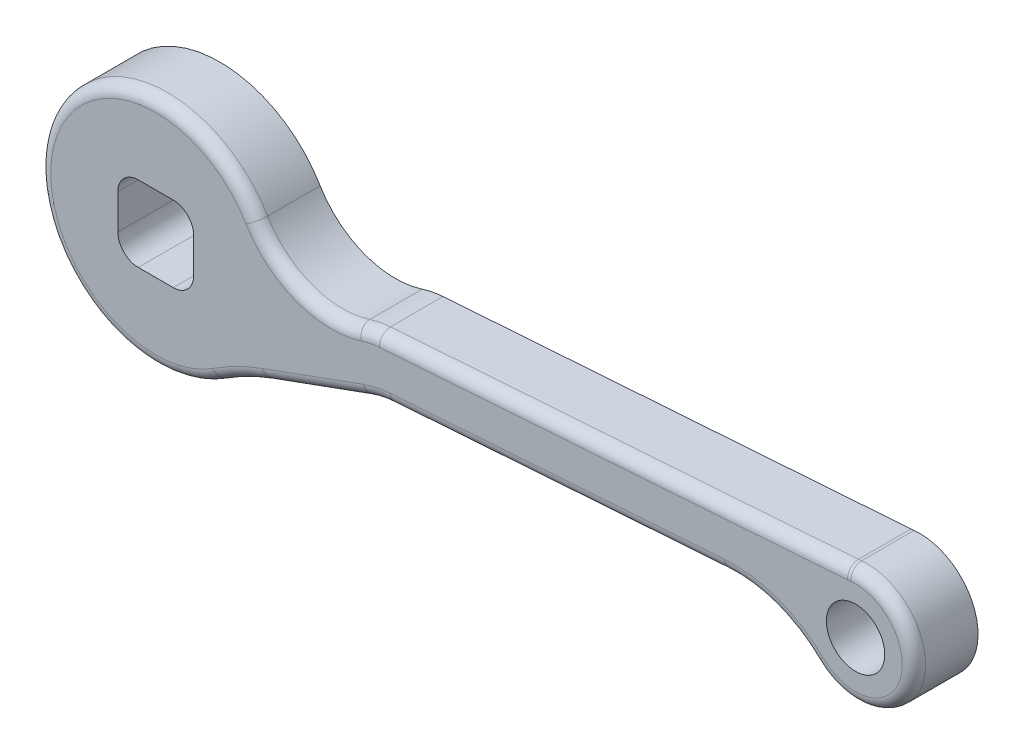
ISO-10303-21;
HEADER;
FILE_DESCRIPTION(('STEP AP214'),'2;1');
FILE_NAME('part.step','',(''),(''),'','','');
FILE_SCHEMA(('AUTOMOTIVE_DESIGN { 1 0 10303 214 1 1 1 1 }'));
ENDSEC;
DATA;
#1=APPLICATION_CONTEXT('core data for automotive mechanical design processes');
#2=APPLICATION_PROTOCOL_DEFINITION('international standard','automotive_design',2000,#1);
#3=PRODUCT_CONTEXT('',#1,'mechanical');
#4=PRODUCT('Part','Part','',(#3));
#5=PRODUCT_RELATED_PRODUCT_CATEGORY('part','',(#4));
#6=PRODUCT_DEFINITION_FORMATION('','',#4);
#7=PRODUCT_DEFINITION_CONTEXT('part definition',#1,'design');
#8=PRODUCT_DEFINITION('design','',#6,#7);
#9=PRODUCT_DEFINITION_SHAPE('','',#8);
#10=(LENGTH_UNIT() NAMED_UNIT(*) SI_UNIT(.MILLI.,.METRE.));
#11=(NAMED_UNIT(*) PLANE_ANGLE_UNIT() SI_UNIT($,.RADIAN.));
#12=(NAMED_UNIT(*) SI_UNIT($,.STERADIAN.) SOLID_ANGLE_UNIT());
#13=UNCERTAINTY_MEASURE_WITH_UNIT(LENGTH_MEASURE(1.E-05),#10,'distance_accuracy_value','');
#14=(GEOMETRIC_REPRESENTATION_CONTEXT(3) GLOBAL_UNCERTAINTY_ASSIGNED_CONTEXT((#13)) GLOBAL_UNIT_ASSIGNED_CONTEXT((#10,
#11,#12)) REPRESENTATION_CONTEXT('',''));
#15=CARTESIAN_POINT('',(0.,0.,0.));
#16=DIRECTION('',(0.,0.,1.));
#17=DIRECTION('',(1.,0.,0.));
#18=AXIS2_PLACEMENT_3D('',#15,#16,#17);
#19=CARTESIAN_POINT('',(30.0847533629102,17.8859613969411,11.));
#20=DIRECTION('',(0.,0.,-1.));
#21=DIRECTION('',(-1.,0.,0.));
#22=AXIS2_PLACEMENT_3D('',#19,#20,#21);
#23=PLANE('',#22);
#24=CARTESIAN_POINT('',(39.2901235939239,-10.666817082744,11.));
#25=DIRECTION('',(0.,0.,-1.));
#26=DIRECTION('',(-1.,0.,0.));
#27=AXIS2_PLACEMENT_3D('',#24,#25,#26);
#28=CIRCLE('',#27,13.);
#29=CARTESIAN_POINT('',(38.3832894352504,2.3015155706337,11.));
#30=VERTEX_POINT('',#29);
#31=CARTESIAN_POINT('',(35.3011298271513,1.70605359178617,11.));
#32=VERTEX_POINT('',#31);
#33=EDGE_CURVE('E351',#30,#32,#28,.F.);
#34=ORIENTED_EDGE('',*,*,#33,.T.);
#35=CARTESIAN_POINT('',(30.0847533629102,17.8859613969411,11.));
#36=DIRECTION('',(0.,0.,-1.));
#37=DIRECTION('',(-1.,0.,0.));
#38=AXIS2_PLACEMENT_3D('',#35,#36,#37);
#39=CIRCLE('',#38,17.);
#40=CARTESIAN_POINT('',(15.4721588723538,9.19849443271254,11.));
#41=VERTEX_POINT('',#40);
#42=EDGE_CURVE('E353',#32,#41,#39,.T.);
#43=ORIENTED_EDGE('',*,*,#42,.T.);
#44=CARTESIAN_POINT('',(0.,0.,11.));
#45=DIRECTION('',(0.,0.,-1.));
#46=DIRECTION('',(-1.,0.,0.));
#47=AXIS2_PLACEMENT_3D('',#44,#45,#46);
#48=CIRCLE('',#47,18.);
#49=CARTESIAN_POINT('',(9.80424171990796,-15.0955902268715,11.));
#50=VERTEX_POINT('',#49);
#51=EDGE_CURVE('E333',#41,#50,#48,.F.);
#52=ORIENTED_EDGE('',*,*,#51,.T.);
#53=CARTESIAN_POINT('',(32.6808057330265,-50.3186340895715,11.));
#54=DIRECTION('',(0.,0.,-1.));
#55=DIRECTION('',(-1.,0.,0.));
#56=AXIS2_PLACEMENT_3D('',#53,#54,#55);
#57=CIRCLE('',#56,42.);
#58=CARTESIAN_POINT('',(18.3159597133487,-10.8515440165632,11.));
#59=VERTEX_POINT('',#58);
#60=EDGE_CURVE('E335',#50,#59,#57,.T.);
#61=ORIENTED_EDGE('',*,*,#60,.T.);
#62=DIRECTION('',(0.939692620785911,0.342020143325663,0.));
#63=VECTOR('',#62,1.);
#64=CARTESIAN_POINT('',(37.9441222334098,-3.7074771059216,11.));
#65=LINE('',#64,#63);
#66=CARTESIAN_POINT('',(35.5753307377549,-4.56964670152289,11.));
#67=VERTEX_POINT('',#66);
#68=EDGE_CURVE('E337',#59,#67,#65,.T.);
#69=ORIENTED_EDGE('',*,*,#68,.T.);
#70=CARTESIAN_POINT('',(41.3896731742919,-20.5444212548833,11.));
#71=DIRECTION('',(0.,0.,-1.));
#72=DIRECTION('',(-1.,0.,0.));
#73=AXIS2_PLACEMENT_3D('',#70,#71,#72);
#74=CIRCLE('',#73,17.0000000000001);
#75=CARTESIAN_POINT('',(40.2038131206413,-3.58583240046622,11.));
#76=VERTEX_POINT('',#75);
#77=EDGE_CURVE('E339',#67,#76,#74,.T.);
#78=ORIENTED_EDGE('',*,*,#77,.T.);
#79=DIRECTION('',(0.997564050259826,0.0697564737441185,0.));
#80=VECTOR('',#79,1.);
#81=CARTESIAN_POINT('',(31.6281404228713,-4.18550185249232,11.));
#82=LINE('',#81,#80);
#83=CARTESIAN_POINT('',(97.5646681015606,0.425229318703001,11.));
#84=VERTEX_POINT('',#83);
#85=EDGE_CURVE('E341',#76,#84,#82,.T.);
#86=ORIENTED_EDGE('',*,*,#85,.T.);
#87=CARTESIAN_POINT('',(99.0993105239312,-21.5211797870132,11.));
#88=DIRECTION('',(0.,0.,-1.));
#89=DIRECTION('',(-1.,0.,0.));
#90=AXIS2_PLACEMENT_3D('',#87,#88,#89);
#91=CIRCLE('',#90,22.);
#92=CARTESIAN_POINT('',(114.426482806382,-5.73898127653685,11.));
#93=VERTEX_POINT('',#92);
#94=EDGE_CURVE('E343',#84,#93,#91,.T.);
#95=ORIENTED_EDGE('',*,*,#94,.T.);
#96=CARTESIAN_POINT('',(120.,0.,11.));
#97=DIRECTION('',(0.,0.,-1.));
#98=DIRECTION('',(-1.,0.,0.));
#99=AXIS2_PLACEMENT_3D('',#96,#97,#98);
#100=CIRCLE('',#99,8.);
#101=CARTESIAN_POINT('',(119.22805965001,7.96266965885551,11.));
#102=VERTEX_POINT('',#101);
#103=EDGE_CURVE('E345',#93,#102,#100,.F.);
#104=ORIENTED_EDGE('',*,*,#103,.T.);
#105=CARTESIAN_POINT('',(117.105223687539,29.8600112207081,11.));
#106=DIRECTION('',(0.,0.,-1.));
#107=DIRECTION('',(-1.,0.,0.));
#108=AXIS2_PLACEMENT_3D('',#105,#106,#107);
#109=CIRCLE('',#108,22.);
#110=CARTESIAN_POINT('',(118.639866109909,7.91360211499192,11.));
#111=VERTEX_POINT('',#110);
#112=EDGE_CURVE('E347',#102,#111,#109,.T.);
#113=ORIENTED_EDGE('',*,*,#112,.T.);
#114=DIRECTION('',(-0.997564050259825,-0.0697564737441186,0.));
#115=VECTOR('',#114,1.);
#116=CARTESIAN_POINT('',(31.2096015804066,1.79988244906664,11.));
#117=LINE('',#116,#115);
#118=EDGE_CURVE('E349',#111,#30,#117,.T.);
#119=ORIENTED_EDGE('',*,*,#118,.T.);
#120=EDGE_LOOP('',(#34,#43,#52,#61,#69,#78,#86,#95,#104,#113,#119));
#121=FACE_BOUND('',#120,.T.);
#122=CARTESIAN_POINT('',(120.,0.,11.));
#123=DIRECTION('',(0.,0.,1.));
#124=DIRECTION('',(1.,0.,0.));
#125=AXIS2_PLACEMENT_3D('',#122,#123,#124);
#126=CIRCLE('',#125,5.);
#127=CARTESIAN_POINT('',(125.,0.,11.));
#128=VERTEX_POINT('',#127);
#129=EDGE_CURVE('E275',#128,#128,#126,.T.);
#130=ORIENTED_EDGE('',*,*,#129,.F.);
#131=EDGE_LOOP('',(#130));
#132=FACE_BOUND('',#131,.T.);
#133=CARTESIAN_POINT('',(-3.,3.,11.));
#134=DIRECTION('',(0.,0.,1.));
#135=DIRECTION('',(1.,0.,0.));
#136=AXIS2_PLACEMENT_3D('',#133,#134,#135);
#137=CIRCLE('',#136,3.5);
#138=CARTESIAN_POINT('',(-2.99999999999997,6.5,11.));
#139=VERTEX_POINT('',#138);
#140=CARTESIAN_POINT('',(-6.5,2.99999999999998,11.));
#141=VERTEX_POINT('',#140);
#142=EDGE_CURVE('E216',#139,#141,#137,.T.);
#143=ORIENTED_EDGE('',*,*,#142,.F.);
#144=DIRECTION('',(-1.,0.,0.));
#145=VECTOR('',#144,1.);
#146=CARTESIAN_POINT('',(-2.99999999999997,6.5,11.));
#147=LINE('',#146,#145);
#148=CARTESIAN_POINT('',(2.99999999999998,6.5,11.));
#149=VERTEX_POINT('',#148);
#150=EDGE_CURVE('E258',#149,#139,#147,.T.);
#151=ORIENTED_EDGE('',*,*,#150,.F.);
#152=CARTESIAN_POINT('',(3.00000000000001,3.,11.));
#153=DIRECTION('',(0.,0.,1.));
#154=DIRECTION('',(1.,0.,0.));
#155=AXIS2_PLACEMENT_3D('',#152,#153,#154);
#156=CIRCLE('',#155,3.5);
#157=CARTESIAN_POINT('',(6.50000000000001,2.99999999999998,11.));
#158=VERTEX_POINT('',#157);
#159=EDGE_CURVE('E255',#158,#149,#156,.T.);
#160=ORIENTED_EDGE('',*,*,#159,.F.);
#161=DIRECTION('',(0.,1.,0.));
#162=VECTOR('',#161,1.);
#163=CARTESIAN_POINT('',(6.50000000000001,2.99999999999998,11.));
#164=LINE('',#163,#162);
#165=CARTESIAN_POINT('',(6.50000000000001,-2.99999999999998,11.));
#166=VERTEX_POINT('',#165);
#167=EDGE_CURVE('E253',#166,#158,#164,.T.);
#168=ORIENTED_EDGE('',*,*,#167,.F.);
#169=CARTESIAN_POINT('',(3.00000000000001,-3.,11.));
#170=DIRECTION('',(0.,0.,1.));
#171=DIRECTION('',(1.,0.,0.));
#172=AXIS2_PLACEMENT_3D('',#169,#170,#171);
#173=CIRCLE('',#172,3.5);
#174=CARTESIAN_POINT('',(2.99999999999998,-6.5,11.));
#175=VERTEX_POINT('',#174);
#176=EDGE_CURVE('E251',#175,#166,#173,.T.);
#177=ORIENTED_EDGE('',*,*,#176,.F.);
#178=DIRECTION('',(1.,0.,0.));
#179=VECTOR('',#178,1.);
#180=CARTESIAN_POINT('',(-2.99999999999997,-6.50000000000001,11.));
#181=LINE('',#180,#179);
#182=CARTESIAN_POINT('',(-2.99999999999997,-6.50000000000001,11.));
#183=VERTEX_POINT('',#182);
#184=EDGE_CURVE('E249',#183,#175,#181,.T.);
#185=ORIENTED_EDGE('',*,*,#184,.F.);
#186=CARTESIAN_POINT('',(-3.,-3.,11.));
#187=DIRECTION('',(0.,0.,1.));
#188=DIRECTION('',(1.,0.,0.));
#189=AXIS2_PLACEMENT_3D('',#186,#187,#188);
#190=CIRCLE('',#189,3.5);
#191=CARTESIAN_POINT('',(-6.5,-2.99999999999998,11.));
#192=VERTEX_POINT('',#191);
#193=EDGE_CURVE('E247',#192,#183,#190,.T.);
#194=ORIENTED_EDGE('',*,*,#193,.F.);
#195=DIRECTION('',(0.,-1.,0.));
#196=VECTOR('',#195,1.);
#197=CARTESIAN_POINT('',(-6.5,2.99999999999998,11.));
#198=LINE('',#197,#196);
#199=EDGE_CURVE('E245',#141,#192,#198,.T.);
#200=ORIENTED_EDGE('',*,*,#199,.F.);
#201=EDGE_LOOP('',(#143,#151,#160,#168,#177,#185,#194,#200));
#202=FACE_BOUND('',#201,.T.);
#203=ADVANCED_FACE('F34',(#121,#132,#202),#23,.F.);
#204=CARTESIAN_POINT('',(30.0847533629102,17.8859613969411,0.));
#205=DIRECTION('',(0.,0.,-1.));
#206=DIRECTION('',(-1.,0.,0.));
#207=AXIS2_PLACEMENT_3D('',#204,#205,#206);
#208=PLANE('',#207);
#209=CARTESIAN_POINT('',(120.,0.,0.));
#210=DIRECTION('',(0.,0.,1.));
#211=DIRECTION('',(1.,0.,0.));
#212=AXIS2_PLACEMENT_3D('',#209,#210,#211);
#213=CIRCLE('',#212,5.);
#214=CARTESIAN_POINT('',(125.,0.,0.));
#215=VERTEX_POINT('',#214);
#216=EDGE_CURVE('E217',#215,#215,#213,.T.);
#217=ORIENTED_EDGE('',*,*,#216,.T.);
#218=EDGE_LOOP('',(#217));
#219=FACE_BOUND('',#218,.T.);
#220=CARTESIAN_POINT('',(30.0847533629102,17.8859613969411,0.));
#221=DIRECTION('',(0.,0.,-1.));
#222=DIRECTION('',(-1.,0.,0.));
#223=AXIS2_PLACEMENT_3D('',#220,#221,#222);
#224=CIRCLE('',#223,15.);
#225=CARTESIAN_POINT('',(34.687438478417,3.6095721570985,0.));
#226=VERTEX_POINT('',#225);
#227=CARTESIAN_POINT('',(17.1912876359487,10.2205493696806,0.));
#228=VERTEX_POINT('',#227);
#229=EDGE_CURVE('E278',#226,#228,#224,.T.);
#230=ORIENTED_EDGE('',*,*,#229,.F.);
#231=CARTESIAN_POINT('',(39.2901235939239,-10.666817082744,0.));
#232=DIRECTION('',(0.,0.,1.));
#233=DIRECTION('',(1.,0.,0.));
#234=AXIS2_PLACEMENT_3D('',#231,#232,#233);
#235=CIRCLE('',#234,15.);
#236=CARTESIAN_POINT('',(38.2437764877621,4.29664367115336,0.));
#237=VERTEX_POINT('',#236);
#238=EDGE_CURVE('E308',#237,#226,#235,.T.);
#239=ORIENTED_EDGE('',*,*,#238,.F.);
#240=DIRECTION('',(-0.997564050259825,-0.0697564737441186,0.));
#241=VECTOR('',#240,1.);
#242=CARTESIAN_POINT('',(118.500353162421,9.90873021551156,0.));
#243=LINE('',#242,#241);
#244=CARTESIAN_POINT('',(118.500353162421,9.90873021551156,0.));
#245=VERTEX_POINT('',#244);
#246=EDGE_CURVE('E305',#245,#237,#243,.T.);
#247=ORIENTED_EDGE('',*,*,#246,.F.);
#248=CARTESIAN_POINT('',(117.105223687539,29.8600112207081,0.));
#249=DIRECTION('',(0.,0.,-1.));
#250=DIRECTION('',(-1.,0.,0.));
#251=AXIS2_PLACEMENT_3D('',#248,#249,#250);
#252=CIRCLE('',#251,20.);
#253=CARTESIAN_POINT('',(119.035074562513,9.95333707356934,0.));
#254=VERTEX_POINT('',#253);
#255=EDGE_CURVE('E302',#254,#245,#252,.T.);
#256=ORIENTED_EDGE('',*,*,#255,.F.);
#257=CARTESIAN_POINT('',(120.,0.,0.));
#258=DIRECTION('',(0.,0.,1.));
#259=DIRECTION('',(1.,0.,0.));
#260=AXIS2_PLACEMENT_3D('',#257,#258,#259);
#261=CIRCLE('',#260,10.);
#262=CARTESIAN_POINT('',(113.033103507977,-7.17372659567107,0.));
#263=VERTEX_POINT('',#262);
#264=EDGE_CURVE('E299',#263,#254,#261,.T.);
#265=ORIENTED_EDGE('',*,*,#264,.F.);
#266=CARTESIAN_POINT('',(99.0993105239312,-21.5211797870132,0.));
#267=DIRECTION('',(0.,0.,-1.));
#268=DIRECTION('',(1.,0.,0.));
#269=AXIS2_PLACEMENT_3D('',#266,#267,#268);
#270=CIRCLE('',#269,20.);
#271=CARTESIAN_POINT('',(97.7041810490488,-1.56989878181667,0.));
#272=VERTEX_POINT('',#271);
#273=EDGE_CURVE('E296',#272,#263,#270,.T.);
#274=ORIENTED_EDGE('',*,*,#273,.F.);
#275=DIRECTION('',(0.997564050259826,0.0697564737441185,0.));
#276=VECTOR('',#275,1.);
#277=CARTESIAN_POINT('',(97.7041810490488,-1.56989878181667,0.));
#278=LINE('',#277,#276);
#279=CARTESIAN_POINT('',(40.3433260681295,-5.58096050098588,0.));
#280=VERTEX_POINT('',#279);
#281=EDGE_CURVE('E293',#280,#272,#278,.T.);
#282=ORIENTED_EDGE('',*,*,#281,.F.);
#283=CARTESIAN_POINT('',(41.3896731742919,-20.5444212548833,0.));
#284=DIRECTION('',(0.,0.,-1.));
#285=DIRECTION('',(1.,0.,0.));
#286=AXIS2_PLACEMENT_3D('',#283,#284,#285);
#287=CIRCLE('',#286,15.0000000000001);
#288=CARTESIAN_POINT('',(36.2593710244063,-6.44903194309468,0.));
#289=VERTEX_POINT('',#288);
#290=EDGE_CURVE('E290',#289,#280,#287,.T.);
#291=ORIENTED_EDGE('',*,*,#290,.F.);
#292=DIRECTION('',(0.939692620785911,0.342020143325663,0.));
#293=VECTOR('',#292,1.);
#294=CARTESIAN_POINT('',(36.2593710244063,-6.44903194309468,0.));
#295=LINE('',#294,#293);
#296=CARTESIAN_POINT('',(19.,-12.730929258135,0.));
#297=VERTEX_POINT('',#296);
#298=EDGE_CURVE('E287',#297,#289,#295,.T.);
#299=ORIENTED_EDGE('',*,*,#298,.F.);
#300=CARTESIAN_POINT('',(32.6808057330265,-50.3186340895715,0.));
#301=DIRECTION('',(0.,0.,-1.));
#302=DIRECTION('',(1.,0.,0.));
#303=AXIS2_PLACEMENT_3D('',#300,#301,#302);
#304=CIRCLE('',#303,40.);
#305=CARTESIAN_POINT('',(10.8936019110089,-16.7728780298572,0.));
#306=VERTEX_POINT('',#305);
#307=EDGE_CURVE('E284',#306,#297,#304,.T.);
#308=ORIENTED_EDGE('',*,*,#307,.F.);
#309=CARTESIAN_POINT('',(0.,0.,0.));
#310=DIRECTION('',(0.,0.,1.));
#311=DIRECTION('',(1.,0.,0.));
#312=AXIS2_PLACEMENT_3D('',#309,#310,#311);
#313=CIRCLE('',#312,20.);
#314=EDGE_CURVE('E281',#228,#306,#313,.T.);
#315=ORIENTED_EDGE('',*,*,#314,.F.);
#316=EDGE_LOOP('',(#230,#239,#247,#256,#265,#274,#282,#291,#299,#308,#315));
#317=FACE_BOUND('',#316,.T.);
#318=DIRECTION('',(-1.,0.,0.));
#319=VECTOR('',#318,1.);
#320=CARTESIAN_POINT('',(-2.99999999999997,6.5,0.));
#321=LINE('',#320,#319);
#322=CARTESIAN_POINT('',(2.99999999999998,6.50000000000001,0.));
#323=VERTEX_POINT('',#322);
#324=CARTESIAN_POINT('',(-2.99999999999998,6.5,0.));
#325=VERTEX_POINT('',#324);
#326=EDGE_CURVE('E223',#323,#325,#321,.T.);
#327=ORIENTED_EDGE('',*,*,#326,.T.);
#328=CARTESIAN_POINT('',(-3.,3.,0.));
#329=DIRECTION('',(0.,0.,1.));
#330=DIRECTION('',(1.,0.,0.));
#331=AXIS2_PLACEMENT_3D('',#328,#329,#330);
#332=CIRCLE('',#331,3.5);
#333=CARTESIAN_POINT('',(-6.5,2.99999999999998,0.));
#334=VERTEX_POINT('',#333);
#335=EDGE_CURVE('E209',#325,#334,#332,.T.);
#336=ORIENTED_EDGE('',*,*,#335,.T.);
#337=DIRECTION('',(0.,-1.,0.));
#338=VECTOR('',#337,1.);
#339=CARTESIAN_POINT('',(-6.5,2.99999999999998,0.));
#340=LINE('',#339,#338);
#341=CARTESIAN_POINT('',(-6.5,-2.99999999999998,0.));
#342=VERTEX_POINT('',#341);
#343=EDGE_CURVE('E197',#334,#342,#340,.T.);
#344=ORIENTED_EDGE('',*,*,#343,.T.);
#345=CARTESIAN_POINT('',(-3.,-3.,0.));
#346=DIRECTION('',(0.,0.,1.));
#347=DIRECTION('',(1.,0.,0.));
#348=AXIS2_PLACEMENT_3D('',#345,#346,#347);
#349=CIRCLE('',#348,3.5);
#350=CARTESIAN_POINT('',(-2.99999999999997,-6.50000000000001,0.));
#351=VERTEX_POINT('',#350);
#352=EDGE_CURVE('E208',#342,#351,#349,.T.);
#353=ORIENTED_EDGE('',*,*,#352,.T.);
#354=DIRECTION('',(1.,0.,0.));
#355=VECTOR('',#354,1.);
#356=CARTESIAN_POINT('',(-2.99999999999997,-6.50000000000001,0.));
#357=LINE('',#356,#355);
#358=CARTESIAN_POINT('',(2.99999999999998,-6.5,0.));
#359=VERTEX_POINT('',#358);
#360=EDGE_CURVE('E232',#351,#359,#357,.T.);
#361=ORIENTED_EDGE('',*,*,#360,.T.);
#362=CARTESIAN_POINT('',(3.00000000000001,-3.,0.));
#363=DIRECTION('',(0.,0.,1.));
#364=DIRECTION('',(1.,0.,0.));
#365=AXIS2_PLACEMENT_3D('',#362,#363,#364);
#366=CIRCLE('',#365,3.5);
#367=CARTESIAN_POINT('',(6.50000000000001,-2.99999999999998,0.));
#368=VERTEX_POINT('',#367);
#369=EDGE_CURVE('E235',#359,#368,#366,.T.);
#370=ORIENTED_EDGE('',*,*,#369,.T.);
#371=DIRECTION('',(0.,1.,0.));
#372=VECTOR('',#371,1.);
#373=CARTESIAN_POINT('',(6.50000000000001,2.99999999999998,0.));
#374=LINE('',#373,#372);
#375=CARTESIAN_POINT('',(6.50000000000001,2.99999999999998,0.));
#376=VERTEX_POINT('',#375);
#377=EDGE_CURVE('E238',#368,#376,#374,.T.);
#378=ORIENTED_EDGE('',*,*,#377,.T.);
#379=CARTESIAN_POINT('',(3.,3.,0.));
#380=DIRECTION('',(0.,0.,1.));
#381=DIRECTION('',(1.,0.,0.));
#382=AXIS2_PLACEMENT_3D('',#379,#380,#381);
#383=CIRCLE('',#382,3.5);
#384=EDGE_CURVE('E241',#376,#323,#383,.T.);
#385=ORIENTED_EDGE('',*,*,#384,.T.);
#386=EDGE_LOOP('',(#327,#336,#344,#353,#361,#370,#378,#385));
#387=FACE_BOUND('',#386,.T.);
#388=ADVANCED_FACE('F220',(#219,#317,#387),#208,.T.);
#389=CARTESIAN_POINT('',(30.0847533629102,17.8859613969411,11.));
#390=DIRECTION('',(0.,0.,-1.));
#391=DIRECTION('',(-1.,0.,0.));
#392=AXIS2_PLACEMENT_3D('',#389,#390,#391);
#393=CYLINDRICAL_SURFACE('',#392,15.);
#394=DIRECTION('',(0.,0.,-1.));
#395=VECTOR('',#394,1.);
#396=CARTESIAN_POINT('',(17.1912876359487,10.2205493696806,11.));
#397=LINE('',#396,#395);
#398=CARTESIAN_POINT('',(17.1912876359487,10.2205493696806,8.99999999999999));
#399=VERTEX_POINT('',#398);
#400=EDGE_CURVE('E331',#399,#228,#397,.T.);
#401=ORIENTED_EDGE('',*,*,#400,.F.);
#402=CARTESIAN_POINT('',(30.0847533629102,17.8859613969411,8.99999999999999));
#403=DIRECTION('',(0.,0.,-1.));
#404=DIRECTION('',(-1.,0.,0.));
#405=AXIS2_PLACEMENT_3D('',#402,#403,#404);
#406=CIRCLE('',#405,15.);
#407=CARTESIAN_POINT('',(34.687438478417,3.6095721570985,8.99999999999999));
#408=VERTEX_POINT('',#407);
#409=EDGE_CURVE('E356',#399,#408,#406,.F.);
#410=ORIENTED_EDGE('',*,*,#409,.T.);
#411=DIRECTION('',(0.,0.,-1.));
#412=VECTOR('',#411,1.);
#413=CARTESIAN_POINT('',(34.687438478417,3.6095721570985,11.));
#414=LINE('',#413,#412);
#415=EDGE_CURVE('E311',#408,#226,#414,.T.);
#416=ORIENTED_EDGE('',*,*,#415,.T.);
#417=ORIENTED_EDGE('',*,*,#229,.T.);
#418=EDGE_LOOP('',(#401,#410,#416,#417));
#419=FACE_BOUND('',#418,.T.);
#420=ADVANCED_FACE('F36',(#419),#393,.F.);
#421=CARTESIAN_POINT('',(0.,0.,11.));
#422=DIRECTION('',(0.,0.,-1.));
#423=DIRECTION('',(-1.,0.,0.));
#424=AXIS2_PLACEMENT_3D('',#421,#422,#423);
#425=CYLINDRICAL_SURFACE('',#424,20.);
#426=DIRECTION('',(0.,0.,-1.));
#427=VECTOR('',#426,1.);
#428=CARTESIAN_POINT('',(10.8936019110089,-16.7728780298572,11.));
#429=LINE('',#428,#427);
#430=CARTESIAN_POINT('',(10.8936019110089,-16.7728780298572,8.99999999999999));
#431=VERTEX_POINT('',#430);
#432=EDGE_CURVE('E329',#431,#306,#429,.T.);
#433=ORIENTED_EDGE('',*,*,#432,.F.);
#434=CARTESIAN_POINT('',(0.,0.,8.99999999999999));
#435=DIRECTION('',(0.,0.,-1.));
#436=DIRECTION('',(-1.,0.,0.));
#437=AXIS2_PLACEMENT_3D('',#434,#435,#436);
#438=CIRCLE('',#437,20.);
#439=EDGE_CURVE('E11',#431,#399,#438,.T.);
#440=ORIENTED_EDGE('',*,*,#439,.T.);
#441=ORIENTED_EDGE('',*,*,#400,.T.);
#442=ORIENTED_EDGE('',*,*,#314,.T.);
#443=EDGE_LOOP('',(#433,#440,#441,#442));
#444=FACE_BOUND('',#443,.T.);
#445=ADVANCED_FACE('F415',(#444),#425,.T.);
#446=CARTESIAN_POINT('',(32.6808057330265,-50.3186340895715,11.));
#447=DIRECTION('',(0.,0.,-1.));
#448=DIRECTION('',(-1.,0.,0.));
#449=AXIS2_PLACEMENT_3D('',#446,#447,#448);
#450=CYLINDRICAL_SURFACE('',#449,40.);
#451=DIRECTION('',(0.,0.,-1.));
#452=VECTOR('',#451,1.);
#453=CARTESIAN_POINT('',(19.,-12.730929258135,11.));
#454=LINE('',#453,#452);
#455=CARTESIAN_POINT('',(19.,-12.730929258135,8.99999999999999));
#456=VERTEX_POINT('',#455);
#457=EDGE_CURVE('E327',#456,#297,#454,.T.);
#458=ORIENTED_EDGE('',*,*,#457,.F.);
#459=CARTESIAN_POINT('',(32.6808057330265,-50.3186340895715,8.99999999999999));
#460=DIRECTION('',(0.,0.,-1.));
#461=DIRECTION('',(-1.,0.,0.));
#462=AXIS2_PLACEMENT_3D('',#459,#460,#461);
#463=CIRCLE('',#462,40.);
#464=EDGE_CURVE('E42',#456,#431,#463,.F.);
#465=ORIENTED_EDGE('',*,*,#464,.T.);
#466=ORIENTED_EDGE('',*,*,#432,.T.);
#467=ORIENTED_EDGE('',*,*,#307,.T.);
#468=EDGE_LOOP('',(#458,#465,#466,#467));
#469=FACE_BOUND('',#468,.T.);
#470=ADVANCED_FACE('F525',(#469),#450,.F.);
#471=CARTESIAN_POINT('',(36.2593710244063,-6.44903194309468,11.));
#472=DIRECTION('',(-0.342020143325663,0.939692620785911,0.));
#473=DIRECTION('',(-0.939692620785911,-0.342020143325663,0.));
#474=AXIS2_PLACEMENT_3D('',#471,#472,#473);
#475=PLANE('',#474);
#476=DIRECTION('',(0.,0.,-1.));
#477=VECTOR('',#476,1.);
#478=CARTESIAN_POINT('',(36.2593710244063,-6.44903194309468,11.));
#479=LINE('',#478,#477);
#480=CARTESIAN_POINT('',(36.2593710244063,-6.44903194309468,8.99999999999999));
#481=VERTEX_POINT('',#480);
#482=EDGE_CURVE('E325',#481,#289,#479,.T.);
#483=ORIENTED_EDGE('',*,*,#482,.F.);
#484=DIRECTION('',(0.939692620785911,0.342020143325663,0.));
#485=VECTOR('',#484,1.);
#486=CARTESIAN_POINT('',(36.2593710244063,-6.44903194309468,8.99999999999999));
#487=LINE('',#486,#485);
#488=EDGE_CURVE('E56',#481,#456,#487,.F.);
#489=ORIENTED_EDGE('',*,*,#488,.T.);
#490=ORIENTED_EDGE('',*,*,#457,.T.);
#491=ORIENTED_EDGE('',*,*,#298,.T.);
#492=EDGE_LOOP('',(#483,#489,#490,#491));
#493=FACE_BOUND('',#492,.T.);
#494=ADVANCED_FACE('F381',(#493),#475,.F.);
#495=CARTESIAN_POINT('',(41.3896731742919,-20.5444212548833,11.));
#496=DIRECTION('',(0.,0.,-1.));
#497=DIRECTION('',(-1.,0.,0.));
#498=AXIS2_PLACEMENT_3D('',#495,#496,#497);
#499=CYLINDRICAL_SURFACE('',#498,15.0000000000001);
#500=DIRECTION('',(0.,0.,-1.));
#501=VECTOR('',#500,1.);
#502=CARTESIAN_POINT('',(40.3433260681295,-5.58096050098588,11.));
#503=LINE('',#502,#501);
#504=CARTESIAN_POINT('',(40.3433260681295,-5.58096050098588,8.99999999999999));
#505=VERTEX_POINT('',#504);
#506=EDGE_CURVE('E323',#505,#280,#503,.T.);
#507=ORIENTED_EDGE('',*,*,#506,.F.);
#508=CARTESIAN_POINT('',(41.3896731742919,-20.5444212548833,8.99999999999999));
#509=DIRECTION('',(0.,0.,-1.));
#510=DIRECTION('',(-1.,0.,0.));
#511=AXIS2_PLACEMENT_3D('',#508,#509,#510);
#512=CIRCLE('',#511,15.0000000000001);
#513=EDGE_CURVE('E371',#505,#481,#512,.F.);
#514=ORIENTED_EDGE('',*,*,#513,.T.);
#515=ORIENTED_EDGE('',*,*,#482,.T.);
#516=ORIENTED_EDGE('',*,*,#290,.T.);
#517=EDGE_LOOP('',(#507,#514,#515,#516));
#518=FACE_BOUND('',#517,.T.);
#519=ADVANCED_FACE('F376',(#518),#499,.F.);
#520=CARTESIAN_POINT('',(97.7041810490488,-1.56989878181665,11.));
#521=DIRECTION('',(-0.0697564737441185,0.997564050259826,0.));
#522=DIRECTION('',(-0.997564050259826,-0.0697564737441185,0.));
#523=AXIS2_PLACEMENT_3D('',#520,#521,#522);
#524=PLANE('',#523);
#525=DIRECTION('',(0.,0.,-1.));
#526=VECTOR('',#525,1.);
#527=CARTESIAN_POINT('',(97.7041810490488,-1.56989878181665,11.));
#528=LINE('',#527,#526);
#529=CARTESIAN_POINT('',(97.7041810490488,-1.56989878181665,8.99999999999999));
#530=VERTEX_POINT('',#529);
#531=EDGE_CURVE('E321',#530,#272,#528,.T.);
#532=ORIENTED_EDGE('',*,*,#531,.F.);
#533=DIRECTION('',(0.997564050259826,0.0697564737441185,0.));
#534=VECTOR('',#533,1.);
#535=CARTESIAN_POINT('',(97.7041810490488,-1.56989878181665,8.99999999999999));
#536=LINE('',#535,#534);
#537=EDGE_CURVE('E369',#530,#505,#536,.F.);
#538=ORIENTED_EDGE('',*,*,#537,.T.);
#539=ORIENTED_EDGE('',*,*,#506,.T.);
#540=ORIENTED_EDGE('',*,*,#281,.T.);
#541=EDGE_LOOP('',(#532,#538,#539,#540));
#542=FACE_BOUND('',#541,.T.);
#543=ADVANCED_FACE('F473',(#542),#524,.F.);
#544=CARTESIAN_POINT('',(99.0993105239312,-21.5211797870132,11.));
#545=DIRECTION('',(0.,0.,-1.));
#546=DIRECTION('',(-1.,0.,0.));
#547=AXIS2_PLACEMENT_3D('',#544,#545,#546);
#548=CYLINDRICAL_SURFACE('',#547,20.);
#549=DIRECTION('',(0.,0.,-1.));
#550=VECTOR('',#549,1.);
#551=CARTESIAN_POINT('',(113.033103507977,-7.17372659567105,11.));
#552=LINE('',#551,#550);
#553=CARTESIAN_POINT('',(113.033103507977,-7.17372659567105,8.99999999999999));
#554=VERTEX_POINT('',#553);
#555=EDGE_CURVE('E319',#554,#263,#552,.T.);
#556=ORIENTED_EDGE('',*,*,#555,.F.);
#557=CARTESIAN_POINT('',(99.0993105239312,-21.5211797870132,8.99999999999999));
#558=DIRECTION('',(0.,0.,-1.));
#559=DIRECTION('',(-1.,0.,0.));
#560=AXIS2_PLACEMENT_3D('',#557,#558,#559);
#561=CIRCLE('',#560,20.);
#562=EDGE_CURVE('E367',#554,#530,#561,.F.);
#563=ORIENTED_EDGE('',*,*,#562,.T.);
#564=ORIENTED_EDGE('',*,*,#531,.T.);
#565=ORIENTED_EDGE('',*,*,#273,.T.);
#566=EDGE_LOOP('',(#556,#563,#564,#565));
#567=FACE_BOUND('',#566,.T.);
#568=ADVANCED_FACE('F471',(#567),#548,.F.);
#569=CARTESIAN_POINT('',(120.,0.,11.));
#570=DIRECTION('',(0.,0.,-1.));
#571=DIRECTION('',(-1.,0.,0.));
#572=AXIS2_PLACEMENT_3D('',#569,#570,#571);
#573=CYLINDRICAL_SURFACE('',#572,10.);
#574=DIRECTION('',(0.,0.,-1.));
#575=VECTOR('',#574,1.);
#576=CARTESIAN_POINT('',(119.035074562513,9.95333707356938,11.));
#577=LINE('',#576,#575);
#578=CARTESIAN_POINT('',(119.035074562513,9.95333707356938,8.99999999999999));
#579=VERTEX_POINT('',#578);
#580=EDGE_CURVE('E317',#579,#254,#577,.T.);
#581=ORIENTED_EDGE('',*,*,#580,.F.);
#582=CARTESIAN_POINT('',(120.,0.,8.99999999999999));
#583=DIRECTION('',(0.,0.,-1.));
#584=DIRECTION('',(-1.,0.,0.));
#585=AXIS2_PLACEMENT_3D('',#582,#583,#584);
#586=CIRCLE('',#585,10.);
#587=EDGE_CURVE('E365',#579,#554,#586,.T.);
#588=ORIENTED_EDGE('',*,*,#587,.T.);
#589=ORIENTED_EDGE('',*,*,#555,.T.);
#590=ORIENTED_EDGE('',*,*,#264,.T.);
#591=EDGE_LOOP('',(#581,#588,#589,#590));
#592=FACE_BOUND('',#591,.T.);
#593=ADVANCED_FACE('F481',(#592),#573,.T.);
#594=CARTESIAN_POINT('',(117.105223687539,29.8600112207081,11.));
#595=DIRECTION('',(0.,0.,-1.));
#596=DIRECTION('',(-1.,0.,0.));
#597=AXIS2_PLACEMENT_3D('',#594,#595,#596);
#598=CYLINDRICAL_SURFACE('',#597,20.);
#599=DIRECTION('',(0.,0.,-1.));
#600=VECTOR('',#599,1.);
#601=CARTESIAN_POINT('',(118.500353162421,9.90873021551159,11.));
#602=LINE('',#601,#600);
#603=CARTESIAN_POINT('',(118.500353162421,9.90873021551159,8.99999999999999));
#604=VERTEX_POINT('',#603);
#605=EDGE_CURVE('E315',#604,#245,#602,.T.);
#606=ORIENTED_EDGE('',*,*,#605,.F.);
#607=CARTESIAN_POINT('',(117.105223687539,29.8600112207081,9.00000000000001));
#608=DIRECTION('',(0.,0.,-1.));
#609=DIRECTION('',(-1.,0.,0.));
#610=AXIS2_PLACEMENT_3D('',#607,#608,#609);
#611=CIRCLE('',#610,20.);
#612=EDGE_CURVE('E363',#604,#579,#611,.F.);
#613=ORIENTED_EDGE('',*,*,#612,.T.);
#614=ORIENTED_EDGE('',*,*,#580,.T.);
#615=ORIENTED_EDGE('',*,*,#255,.T.);
#616=EDGE_LOOP('',(#606,#613,#614,#615));
#617=FACE_BOUND('',#616,.T.);
#618=ADVANCED_FACE('F483',(#617),#598,.F.);
#619=CARTESIAN_POINT('',(118.500353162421,9.90873021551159,11.));
#620=DIRECTION('',(0.0697564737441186,-0.997564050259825,0.));
#621=DIRECTION('',(0.997564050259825,0.0697564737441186,0.));
#622=AXIS2_PLACEMENT_3D('',#619,#620,#621);
#623=PLANE('',#622);
#624=DIRECTION('',(0.,0.,-1.));
#625=VECTOR('',#624,1.);
#626=CARTESIAN_POINT('',(38.2437764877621,4.29664367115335,11.));
#627=LINE('',#626,#625);
#628=CARTESIAN_POINT('',(38.2437764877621,4.29664367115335,8.99999999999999));
#629=VERTEX_POINT('',#628);
#630=EDGE_CURVE('E313',#629,#237,#627,.T.);
#631=ORIENTED_EDGE('',*,*,#630,.F.);
#632=DIRECTION('',(-0.997564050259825,-0.0697564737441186,0.));
#633=VECTOR('',#632,1.);
#634=CARTESIAN_POINT('',(118.500353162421,9.90873021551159,8.99999999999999));
#635=LINE('',#634,#633);
#636=EDGE_CURVE('E361',#629,#604,#635,.F.);
#637=ORIENTED_EDGE('',*,*,#636,.T.);
#638=ORIENTED_EDGE('',*,*,#605,.T.);
#639=ORIENTED_EDGE('',*,*,#246,.T.);
#640=EDGE_LOOP('',(#631,#637,#638,#639));
#641=FACE_BOUND('',#640,.T.);
#642=ADVANCED_FACE('F437',(#641),#623,.F.);
#643=CARTESIAN_POINT('',(39.2901235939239,-10.666817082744,11.));
#644=DIRECTION('',(0.,0.,-1.));
#645=DIRECTION('',(-1.,0.,0.));
#646=AXIS2_PLACEMENT_3D('',#643,#644,#645);
#647=CYLINDRICAL_SURFACE('',#646,15.);
#648=ORIENTED_EDGE('',*,*,#415,.F.);
#649=CARTESIAN_POINT('',(39.2901235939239,-10.666817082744,8.99999999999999));
#650=DIRECTION('',(0.,0.,-1.));
#651=DIRECTION('',(-1.,0.,0.));
#652=AXIS2_PLACEMENT_3D('',#649,#650,#651);
#653=CIRCLE('',#652,15.);
#654=EDGE_CURVE('E359',#408,#629,#653,.T.);
#655=ORIENTED_EDGE('',*,*,#654,.T.);
#656=ORIENTED_EDGE('',*,*,#630,.T.);
#657=ORIENTED_EDGE('',*,*,#238,.T.);
#658=EDGE_LOOP('',(#648,#655,#656,#657));
#659=FACE_BOUND('',#658,.T.);
#660=ADVANCED_FACE('F434',(#659),#647,.T.);
#661=CARTESIAN_POINT('',(120.,0.,11.));
#662=DIRECTION('',(0.,0.,-1.));
#663=DIRECTION('',(-1.,0.,0.));
#664=AXIS2_PLACEMENT_3D('',#661,#662,#663);
#665=CYLINDRICAL_SURFACE('',#664,5.);
#666=ORIENTED_EDGE('',*,*,#129,.T.);
#667=EDGE_LOOP('',(#666));
#668=FACE_BOUND('',#667,.T.);
#669=ORIENTED_EDGE('',*,*,#216,.F.);
#670=EDGE_LOOP('',(#669));
#671=FACE_BOUND('',#670,.T.);
#672=ADVANCED_FACE('F510',(#668,#671),#665,.F.);
#673=CARTESIAN_POINT('',(-3.,3.,11.));
#674=DIRECTION('',(0.,0.,-1.));
#675=DIRECTION('',(-1.,0.,0.));
#676=AXIS2_PLACEMENT_3D('',#673,#674,#675);
#677=CYLINDRICAL_SURFACE('',#676,3.5);
#678=ORIENTED_EDGE('',*,*,#335,.F.);
#679=DIRECTION('',(0.,0.,-1.));
#680=VECTOR('',#679,1.);
#681=CARTESIAN_POINT('',(-2.99999999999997,6.5,11.));
#682=LINE('',#681,#680);
#683=EDGE_CURVE('E260',#139,#325,#682,.T.);
#684=ORIENTED_EDGE('',*,*,#683,.F.);
#685=ORIENTED_EDGE('',*,*,#142,.T.);
#686=DIRECTION('',(0.,0.,-1.));
#687=VECTOR('',#686,1.);
#688=CARTESIAN_POINT('',(-6.5,2.99999999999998,11.));
#689=LINE('',#688,#687);
#690=EDGE_CURVE('E200',#141,#334,#689,.T.);
#691=ORIENTED_EDGE('',*,*,#690,.T.);
#692=EDGE_LOOP('',(#678,#684,#685,#691));
#693=FACE_BOUND('',#692,.T.);
#694=ADVANCED_FACE('F212',(#693),#677,.F.);
#695=CARTESIAN_POINT('',(-6.5,2.99999999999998,11.));
#696=DIRECTION('',(1.,0.,0.));
#697=DIRECTION('',(0.,1.,0.));
#698=AXIS2_PLACEMENT_3D('',#695,#696,#697);
#699=PLANE('',#698);
#700=ORIENTED_EDGE('',*,*,#343,.F.);
#701=ORIENTED_EDGE('',*,*,#690,.F.);
#702=ORIENTED_EDGE('',*,*,#199,.T.);
#703=DIRECTION('',(0.,0.,-1.));
#704=VECTOR('',#703,1.);
#705=CARTESIAN_POINT('',(-6.5,-2.99999999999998,11.));
#706=LINE('',#705,#704);
#707=EDGE_CURVE('E203',#192,#342,#706,.T.);
#708=ORIENTED_EDGE('',*,*,#707,.T.);
#709=EDGE_LOOP('',(#700,#701,#702,#708));
#710=FACE_BOUND('',#709,.T.);
#711=ADVANCED_FACE('F199',(#710),#699,.T.);
#712=CARTESIAN_POINT('',(-3.,-3.,11.));
#713=DIRECTION('',(0.,0.,-1.));
#714=DIRECTION('',(-1.,0.,0.));
#715=AXIS2_PLACEMENT_3D('',#712,#713,#714);
#716=CYLINDRICAL_SURFACE('',#715,3.5);
#717=ORIENTED_EDGE('',*,*,#352,.F.);
#718=ORIENTED_EDGE('',*,*,#707,.F.);
#719=ORIENTED_EDGE('',*,*,#193,.T.);
#720=DIRECTION('',(0.,0.,-1.));
#721=VECTOR('',#720,1.);
#722=CARTESIAN_POINT('',(-2.99999999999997,-6.50000000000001,11.));
#723=LINE('',#722,#721);
#724=EDGE_CURVE('E270',#183,#351,#723,.T.);
#725=ORIENTED_EDGE('',*,*,#724,.T.);
#726=EDGE_LOOP('',(#717,#718,#719,#725));
#727=FACE_BOUND('',#726,.T.);
#728=ADVANCED_FACE('F616',(#727),#716,.F.);
#729=CARTESIAN_POINT('',(-2.99999999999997,-6.50000000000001,11.));
#730=DIRECTION('',(0.,1.,0.));
#731=DIRECTION('',(0.,0.,1.));
#732=AXIS2_PLACEMENT_3D('',#729,#730,#731);
#733=PLANE('',#732);
#734=ORIENTED_EDGE('',*,*,#360,.F.);
#735=ORIENTED_EDGE('',*,*,#724,.F.);
#736=ORIENTED_EDGE('',*,*,#184,.T.);
#737=DIRECTION('',(0.,0.,-1.));
#738=VECTOR('',#737,1.);
#739=CARTESIAN_POINT('',(2.99999999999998,-6.5,11.));
#740=LINE('',#739,#738);
#741=EDGE_CURVE('E268',#175,#359,#740,.T.);
#742=ORIENTED_EDGE('',*,*,#741,.T.);
#743=EDGE_LOOP('',(#734,#735,#736,#742));
#744=FACE_BOUND('',#743,.T.);
#745=ADVANCED_FACE('F624',(#744),#733,.T.);
#746=CARTESIAN_POINT('',(3.00000000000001,-3.,11.));
#747=DIRECTION('',(0.,0.,-1.));
#748=DIRECTION('',(-1.,0.,0.));
#749=AXIS2_PLACEMENT_3D('',#746,#747,#748);
#750=CYLINDRICAL_SURFACE('',#749,3.5);
#751=ORIENTED_EDGE('',*,*,#369,.F.);
#752=ORIENTED_EDGE('',*,*,#741,.F.);
#753=ORIENTED_EDGE('',*,*,#176,.T.);
#754=DIRECTION('',(0.,0.,-1.));
#755=VECTOR('',#754,1.);
#756=CARTESIAN_POINT('',(6.50000000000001,-2.99999999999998,11.));
#757=LINE('',#756,#755);
#758=EDGE_CURVE('E266',#166,#368,#757,.T.);
#759=ORIENTED_EDGE('',*,*,#758,.T.);
#760=EDGE_LOOP('',(#751,#752,#753,#759));
#761=FACE_BOUND('',#760,.T.);
#762=ADVANCED_FACE('F633',(#761),#750,.F.);
#763=CARTESIAN_POINT('',(6.50000000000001,2.99999999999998,11.));
#764=DIRECTION('',(-1.,0.,0.));
#765=DIRECTION('',(0.,-1.,0.));
#766=AXIS2_PLACEMENT_3D('',#763,#764,#765);
#767=PLANE('',#766);
#768=ORIENTED_EDGE('',*,*,#377,.F.);
#769=ORIENTED_EDGE('',*,*,#758,.F.);
#770=ORIENTED_EDGE('',*,*,#167,.T.);
#771=DIRECTION('',(0.,0.,-1.));
#772=VECTOR('',#771,1.);
#773=CARTESIAN_POINT('',(6.50000000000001,2.99999999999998,11.));
#774=LINE('',#773,#772);
#775=EDGE_CURVE('E264',#158,#376,#774,.T.);
#776=ORIENTED_EDGE('',*,*,#775,.T.);
#777=EDGE_LOOP('',(#768,#769,#770,#776));
#778=FACE_BOUND('',#777,.T.);
#779=ADVANCED_FACE('F642',(#778),#767,.T.);
#780=CARTESIAN_POINT('',(3.00000000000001,3.,11.));
#781=DIRECTION('',(0.,0.,-1.));
#782=DIRECTION('',(-1.,0.,0.));
#783=AXIS2_PLACEMENT_3D('',#780,#781,#782);
#784=CYLINDRICAL_SURFACE('',#783,3.5);
#785=ORIENTED_EDGE('',*,*,#384,.F.);
#786=ORIENTED_EDGE('',*,*,#775,.F.);
#787=ORIENTED_EDGE('',*,*,#159,.T.);
#788=DIRECTION('',(0.,0.,-1.));
#789=VECTOR('',#788,1.);
#790=CARTESIAN_POINT('',(2.99999999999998,6.5,11.));
#791=LINE('',#790,#789);
#792=EDGE_CURVE('E262',#149,#323,#791,.T.);
#793=ORIENTED_EDGE('',*,*,#792,.T.);
#794=EDGE_LOOP('',(#785,#786,#787,#793));
#795=FACE_BOUND('',#794,.T.);
#796=ADVANCED_FACE('F651',(#795),#784,.F.);
#797=CARTESIAN_POINT('',(-2.99999999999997,6.5,11.));
#798=DIRECTION('',(0.,-1.,0.));
#799=DIRECTION('',(0.,0.,-1.));
#800=AXIS2_PLACEMENT_3D('',#797,#798,#799);
#801=PLANE('',#800);
#802=ORIENTED_EDGE('',*,*,#326,.F.);
#803=ORIENTED_EDGE('',*,*,#792,.F.);
#804=ORIENTED_EDGE('',*,*,#150,.T.);
#805=ORIENTED_EDGE('',*,*,#683,.T.);
#806=EDGE_LOOP('',(#802,#803,#804,#805));
#807=FACE_BOUND('',#806,.T.);
#808=ADVANCED_FACE('F497',(#807),#801,.T.);
#809=CARTESIAN_POINT('',(99.0993105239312,-21.5211797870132,8.99999999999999));
#810=DIRECTION('',(0.,0.,-1.));
#811=DIRECTION('',(-1.,0.,0.));
#812=AXIS2_PLACEMENT_3D('',#809,#810,#811);
#813=TOROIDAL_SURFACE('',#812,22.,2.);
#814=CARTESIAN_POINT('',(114.426482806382,-5.73898127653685,8.99999999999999));
#815=DIRECTION('',(0.717372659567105,-0.696689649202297,0.));
#816=DIRECTION('',(0.696689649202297,0.717372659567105,0.));
#817=AXIS2_PLACEMENT_3D('',#814,#815,#816);
#818=CIRCLE('',#817,2.);
#819=EDGE_CURVE('E227',#93,#554,#818,.T.);
#820=ORIENTED_EDGE('',*,*,#819,.F.);
#821=ORIENTED_EDGE('',*,*,#94,.F.);
#822=CARTESIAN_POINT('',(97.5646681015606,0.425229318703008,8.99999999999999));
#823=DIRECTION('',(-0.997564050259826,-0.0697564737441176,0.));
#824=DIRECTION('',(0.0697564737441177,-0.997564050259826,0.));
#825=AXIS2_PLACEMENT_3D('',#822,#823,#824);
#826=CIRCLE('',#825,2.);
#827=EDGE_CURVE('E224',#530,#84,#826,.T.);
#828=ORIENTED_EDGE('',*,*,#827,.F.);
#829=ORIENTED_EDGE('',*,*,#562,.F.);
#830=EDGE_LOOP('',(#820,#821,#828,#829));
#831=FACE_BOUND('',#830,.T.);
#832=ADVANCED_FACE('F465',(#831),#813,.T.);
#833=CARTESIAN_POINT('',(31.6281404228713,-4.18550185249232,8.99999999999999));
#834=DIRECTION('',(0.997564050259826,0.0697564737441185,0.));
#835=DIRECTION('',(-0.0697564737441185,0.997564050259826,0.));
#836=AXIS2_PLACEMENT_3D('',#833,#834,#835);
#837=CYLINDRICAL_SURFACE('',#836,2.);
#838=ORIENTED_EDGE('',*,*,#827,.T.);
#839=ORIENTED_EDGE('',*,*,#85,.F.);
#840=CARTESIAN_POINT('',(40.2038131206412,-3.58583240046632,8.99999999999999));
#841=DIRECTION('',(-0.997564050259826,-0.0697564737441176,0.));
#842=DIRECTION('',(0.0697564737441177,-0.997564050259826,0.));
#843=AXIS2_PLACEMENT_3D('',#840,#841,#842);
#844=CIRCLE('',#843,2.);
#845=EDGE_CURVE('E454',#505,#76,#844,.T.);
#846=ORIENTED_EDGE('',*,*,#845,.F.);
#847=ORIENTED_EDGE('',*,*,#537,.F.);
#848=EDGE_LOOP('',(#838,#839,#846,#847));
#849=FACE_BOUND('',#848,.T.);
#850=ADVANCED_FACE('F489',(#849),#837,.T.);
#851=CARTESIAN_POINT('',(120.,0.,8.99999999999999));
#852=DIRECTION('',(0.,0.,-1.));
#853=DIRECTION('',(-1.,0.,0.));
#854=AXIS2_PLACEMENT_3D('',#851,#852,#853);
#855=TOROIDAL_SURFACE('',#854,8.,2.);
#856=ORIENTED_EDGE('',*,*,#819,.T.);
#857=ORIENTED_EDGE('',*,*,#587,.F.);
#858=CARTESIAN_POINT('',(119.22805965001,7.96266965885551,8.99999999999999));
#859=DIRECTION('',(-0.995333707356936,-0.0964925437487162,0.));
#860=DIRECTION('',(0.0964925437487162,-0.995333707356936,0.));
#861=AXIS2_PLACEMENT_3D('',#858,#859,#860);
#862=CIRCLE('',#861,2.);
#863=EDGE_CURVE('E390',#102,#579,#862,.T.);
#864=ORIENTED_EDGE('',*,*,#863,.F.);
#865=ORIENTED_EDGE('',*,*,#103,.F.);
#866=EDGE_LOOP('',(#856,#857,#864,#865));
#867=FACE_BOUND('',#866,.T.);
#868=ADVANCED_FACE('F460',(#867),#855,.T.);
#869=CARTESIAN_POINT('',(41.3896731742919,-20.5444212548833,8.99999999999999));
#870=DIRECTION('',(0.,0.,-1.));
#871=DIRECTION('',(-1.,0.,0.));
#872=AXIS2_PLACEMENT_3D('',#869,#870,#871);
#873=TOROIDAL_SURFACE('',#872,17.0000000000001,2.);
#874=ORIENTED_EDGE('',*,*,#845,.T.);
#875=ORIENTED_EDGE('',*,*,#77,.F.);
#876=CARTESIAN_POINT('',(35.575330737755,-4.56964670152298,8.99999999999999));
#877=DIRECTION('',(-0.939692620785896,-0.342020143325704,0.));
#878=DIRECTION('',(0.342020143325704,-0.939692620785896,0.));
#879=AXIS2_PLACEMENT_3D('',#876,#877,#878);
#880=CIRCLE('',#879,2.);
#881=EDGE_CURVE('E386',#481,#67,#880,.T.);
#882=ORIENTED_EDGE('',*,*,#881,.F.);
#883=ORIENTED_EDGE('',*,*,#513,.F.);
#884=EDGE_LOOP('',(#874,#875,#882,#883));
#885=FACE_BOUND('',#884,.T.);
#886=ADVANCED_FACE('F387',(#885),#873,.T.);
#887=CARTESIAN_POINT('',(117.105223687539,29.8600112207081,9.00000000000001));
#888=DIRECTION('',(0.,0.,-1.));
#889=DIRECTION('',(-1.,0.,0.));
#890=AXIS2_PLACEMENT_3D('',#887,#888,#889);
#891=TOROIDAL_SURFACE('',#890,22.,2.);
#892=ORIENTED_EDGE('',*,*,#863,.T.);
#893=ORIENTED_EDGE('',*,*,#612,.F.);
#894=CARTESIAN_POINT('',(118.639866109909,7.91360211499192,8.99999999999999));
#895=DIRECTION('',(-0.997564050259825,-0.0697564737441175,0.));
#896=DIRECTION('',(0.0697564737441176,-0.997564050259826,0.));
#897=AXIS2_PLACEMENT_3D('',#894,#895,#896);
#898=CIRCLE('',#897,2.);
#899=EDGE_CURVE('E391',#111,#604,#898,.T.);
#900=ORIENTED_EDGE('',*,*,#899,.F.);
#901=ORIENTED_EDGE('',*,*,#112,.F.);
#902=EDGE_LOOP('',(#892,#893,#900,#901));
#903=FACE_BOUND('',#902,.T.);
#904=ADVANCED_FACE('F484',(#903),#891,.T.);
#905=CARTESIAN_POINT('',(37.9441222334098,-3.7074771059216,8.99999999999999));
#906=DIRECTION('',(0.939692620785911,0.342020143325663,0.));
#907=DIRECTION('',(-0.342020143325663,0.939692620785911,0.));
#908=AXIS2_PLACEMENT_3D('',#905,#906,#907);
#909=CYLINDRICAL_SURFACE('',#908,2.);
#910=ORIENTED_EDGE('',*,*,#881,.T.);
#911=ORIENTED_EDGE('',*,*,#68,.F.);
#912=CARTESIAN_POINT('',(18.3159597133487,-10.8515440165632,8.99999999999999));
#913=DIRECTION('',(-0.939692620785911,-0.342020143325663,0.));
#914=DIRECTION('',(0.342020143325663,-0.939692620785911,0.));
#915=AXIS2_PLACEMENT_3D('',#912,#913,#914);
#916=CIRCLE('',#915,2.);
#917=EDGE_CURVE('E396',#456,#59,#916,.T.);
#918=ORIENTED_EDGE('',*,*,#917,.F.);
#919=ORIENTED_EDGE('',*,*,#488,.F.);
#920=EDGE_LOOP('',(#910,#911,#918,#919));
#921=FACE_BOUND('',#920,.T.);
#922=ADVANCED_FACE('F394',(#921),#909,.T.);
#923=CARTESIAN_POINT('',(31.2096015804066,1.79988244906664,8.99999999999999));
#924=DIRECTION('',(-0.997564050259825,-0.0697564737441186,0.));
#925=DIRECTION('',(0.0697564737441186,-0.997564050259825,0.));
#926=AXIS2_PLACEMENT_3D('',#923,#924,#925);
#927=CYLINDRICAL_SURFACE('',#926,2.);
#928=ORIENTED_EDGE('',*,*,#899,.T.);
#929=ORIENTED_EDGE('',*,*,#636,.F.);
#930=CARTESIAN_POINT('',(38.3832894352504,2.3015155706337,8.99999999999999));
#931=DIRECTION('',(-0.997564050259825,-0.0697564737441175,0.));
#932=DIRECTION('',(0.0697564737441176,-0.997564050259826,0.));
#933=AXIS2_PLACEMENT_3D('',#930,#931,#932);
#934=CIRCLE('',#933,2.);
#935=EDGE_CURVE('E399',#30,#629,#934,.T.);
#936=ORIENTED_EDGE('',*,*,#935,.F.);
#937=ORIENTED_EDGE('',*,*,#118,.F.);
#938=EDGE_LOOP('',(#928,#929,#936,#937));
#939=FACE_BOUND('',#938,.T.);
#940=ADVANCED_FACE('F443',(#939),#927,.T.);
#941=CARTESIAN_POINT('',(32.6808057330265,-50.3186340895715,8.99999999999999));
#942=DIRECTION('',(0.,0.,-1.));
#943=DIRECTION('',(-1.,0.,0.));
#944=AXIS2_PLACEMENT_3D('',#941,#942,#943);
#945=TOROIDAL_SURFACE('',#944,42.,2.);
#946=ORIENTED_EDGE('',*,*,#917,.T.);
#947=ORIENTED_EDGE('',*,*,#60,.F.);
#948=CARTESIAN_POINT('',(9.80424171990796,-15.0955902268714,8.99999999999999));
#949=DIRECTION('',(-0.838643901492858,-0.544680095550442,0.));
#950=DIRECTION('',(0.544680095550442,-0.838643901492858,0.));
#951=AXIS2_PLACEMENT_3D('',#948,#949,#950);
#952=CIRCLE('',#951,2.);
#953=EDGE_CURVE('E404',#431,#50,#952,.T.);
#954=ORIENTED_EDGE('',*,*,#953,.F.);
#955=ORIENTED_EDGE('',*,*,#464,.F.);
#956=EDGE_LOOP('',(#946,#947,#954,#955));
#957=FACE_BOUND('',#956,.T.);
#958=ADVANCED_FACE('F402',(#957),#945,.T.);
#959=CARTESIAN_POINT('',(39.2901235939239,-10.666817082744,8.99999999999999));
#960=DIRECTION('',(0.,0.,-1.));
#961=DIRECTION('',(-1.,0.,0.));
#962=AXIS2_PLACEMENT_3D('',#959,#960,#961);
#963=TOROIDAL_SURFACE('',#962,13.,2.);
#964=ORIENTED_EDGE('',*,*,#935,.T.);
#965=ORIENTED_EDGE('',*,*,#654,.F.);
#966=CARTESIAN_POINT('',(35.3011298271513,1.70605359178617,8.99999999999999));
#967=DIRECTION('',(-0.951759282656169,-0.306845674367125,0.));
#968=DIRECTION('',(0.306845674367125,-0.951759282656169,0.));
#969=AXIS2_PLACEMENT_3D('',#966,#967,#968);
#970=CIRCLE('',#969,2.);
#971=EDGE_CURVE('E408',#32,#408,#970,.T.);
#972=ORIENTED_EDGE('',*,*,#971,.F.);
#973=ORIENTED_EDGE('',*,*,#33,.F.);
#974=EDGE_LOOP('',(#964,#965,#972,#973));
#975=FACE_BOUND('',#974,.T.);
#976=ADVANCED_FACE('F430',(#975),#963,.T.);
#977=CARTESIAN_POINT('',(0.,0.,8.99999999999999));
#978=DIRECTION('',(0.,0.,-1.));
#979=DIRECTION('',(-1.,0.,0.));
#980=AXIS2_PLACEMENT_3D('',#977,#978,#979);
#981=TOROIDAL_SURFACE('',#980,18.,2.);
#982=ORIENTED_EDGE('',*,*,#953,.T.);
#983=ORIENTED_EDGE('',*,*,#51,.F.);
#984=CARTESIAN_POINT('',(15.4721588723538,9.19849443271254,8.99999999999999));
#985=DIRECTION('',(0.511027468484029,-0.859564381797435,0.));
#986=DIRECTION('',(0.859564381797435,0.511027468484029,0.));
#987=AXIS2_PLACEMENT_3D('',#984,#985,#986);
#988=CIRCLE('',#987,2.);
#989=EDGE_CURVE('E412',#399,#41,#988,.T.);
#990=ORIENTED_EDGE('',*,*,#989,.F.);
#991=ORIENTED_EDGE('',*,*,#439,.F.);
#992=EDGE_LOOP('',(#982,#983,#990,#991));
#993=FACE_BOUND('',#992,.T.);
#994=ADVANCED_FACE('F411',(#993),#981,.T.);
#995=CARTESIAN_POINT('',(30.0847533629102,17.8859613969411,8.99999999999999));
#996=DIRECTION('',(0.,0.,-1.));
#997=DIRECTION('',(-1.,0.,0.));
#998=AXIS2_PLACEMENT_3D('',#995,#996,#997);
#999=TOROIDAL_SURFACE('',#998,17.,2.);
#1000=ORIENTED_EDGE('',*,*,#971,.T.);
#1001=ORIENTED_EDGE('',*,*,#409,.F.);
#1002=ORIENTED_EDGE('',*,*,#989,.T.);
#1003=ORIENTED_EDGE('',*,*,#42,.F.);
#1004=EDGE_LOOP('',(#1000,#1001,#1002,#1003));
#1005=FACE_BOUND('',#1004,.T.);
#1006=ADVANCED_FACE('F422',(#1005),#999,.T.);
#1007=CLOSED_SHELL('',(#203,#388,#420,#445,#470,#494,#519,#543,#568,#593,#618,#642,#660,#672,
#694,#711,#728,#745,#762,#779,#796,#808,#832,#850,#868,#886,#904,#922,#940,#958,#976,#994,#1006));
#1008=MANIFOLD_SOLID_BREP('B2',#1007);
#1009=ADVANCED_BREP_SHAPE_REPRESENTATION('',(#18,#1008),#14);
#1010=SHAPE_DEFINITION_REPRESENTATION(#9,#1009);
ENDSEC;
END-ISO-10303-21;
